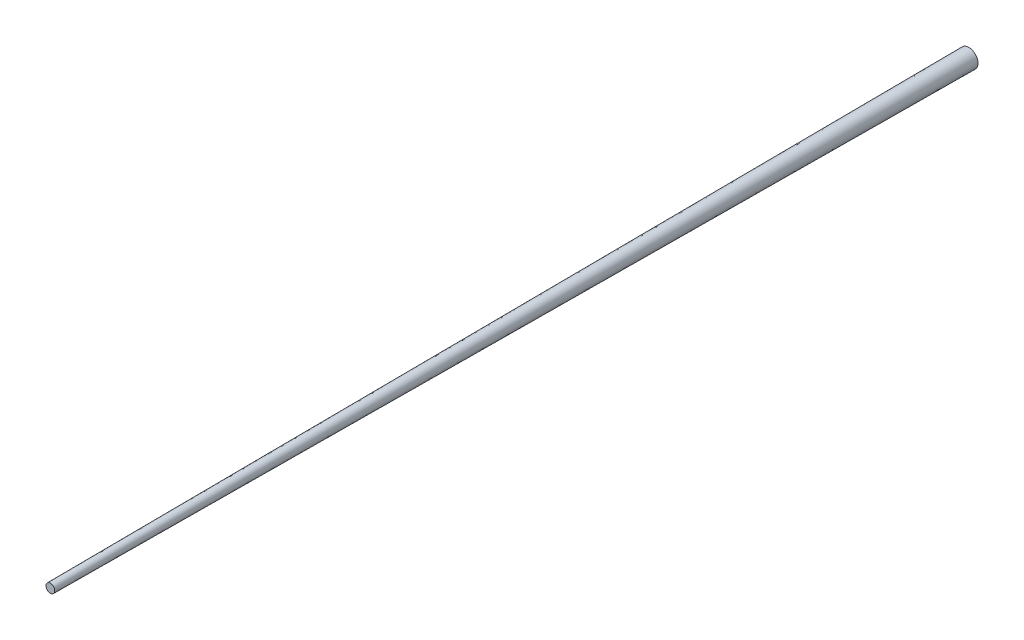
from build123d import *

# Parameters (mm, degrees)
ESQUISSE1_R      = 50
EXTRUSION1_DEPTH = 5000
EXTRUSION1_TAPER = 0.3


with BuildPart() as part:
    # Esquisse1 → Extrusion1 (new body)
    with BuildSketch(Plane.XY):
        Circle(ESQUISSE1_R)
    extrude(amount=EXTRUSION1_DEPTH, taper=EXTRUSION1_TAPER)


solid = part.part
